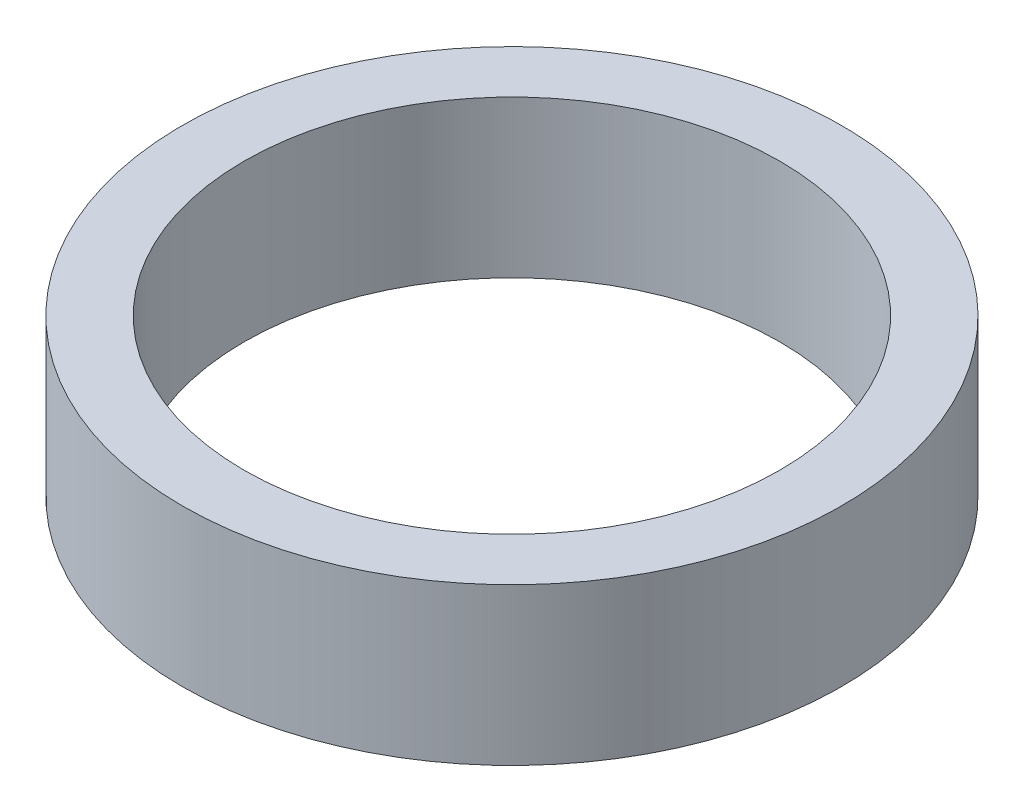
ISO-10303-21;
HEADER;
FILE_DESCRIPTION(('STEP AP214'),'2;1');
FILE_NAME('part.step','',(''),(''),'','','');
FILE_SCHEMA(('AUTOMOTIVE_DESIGN { 1 0 10303 214 1 1 1 1 }'));
ENDSEC;
DATA;
#1=APPLICATION_CONTEXT('core data for automotive mechanical design processes');
#2=APPLICATION_PROTOCOL_DEFINITION('international standard','automotive_design',2000,#1);
#3=PRODUCT_CONTEXT('',#1,'mechanical');
#4=PRODUCT('Part','Part','',(#3));
#5=PRODUCT_RELATED_PRODUCT_CATEGORY('part','',(#4));
#6=PRODUCT_DEFINITION_FORMATION('','',#4);
#7=PRODUCT_DEFINITION_CONTEXT('part definition',#1,'design');
#8=PRODUCT_DEFINITION('design','',#6,#7);
#9=PRODUCT_DEFINITION_SHAPE('','',#8);
#10=(LENGTH_UNIT() NAMED_UNIT(*) SI_UNIT(.MILLI.,.METRE.));
#11=(NAMED_UNIT(*) PLANE_ANGLE_UNIT() SI_UNIT($,.RADIAN.));
#12=(NAMED_UNIT(*) SI_UNIT($,.STERADIAN.) SOLID_ANGLE_UNIT());
#13=UNCERTAINTY_MEASURE_WITH_UNIT(LENGTH_MEASURE(1.E-05),#10,'distance_accuracy_value','');
#14=(GEOMETRIC_REPRESENTATION_CONTEXT(3) GLOBAL_UNCERTAINTY_ASSIGNED_CONTEXT((#13)) GLOBAL_UNIT_ASSIGNED_CONTEXT((#10,
#11,#12)) REPRESENTATION_CONTEXT('',''));
#15=CARTESIAN_POINT('',(0.,0.,0.));
#16=DIRECTION('',(0.,0.,1.));
#17=DIRECTION('',(1.,0.,0.));
#18=AXIS2_PLACEMENT_3D('',#15,#16,#17);
#19=CARTESIAN_POINT('',(0.,19.,0.));
#20=DIRECTION('',(0.,-1.,0.));
#21=DIRECTION('',(0.,0.,-1.));
#22=AXIS2_PLACEMENT_3D('',#19,#20,#21);
#23=CYLINDRICAL_SURFACE('',#22,40.);
#24=CARTESIAN_POINT('',(0.,19.,0.));
#25=DIRECTION('',(0.,1.,0.));
#26=DIRECTION('',(0.,0.,1.));
#27=AXIS2_PLACEMENT_3D('',#24,#25,#26);
#28=CIRCLE('',#27,40.);
#29=CARTESIAN_POINT('',(0.,19.,40.));
#30=VERTEX_POINT('',#29);
#31=EDGE_CURVE('E10',#30,#30,#28,.T.);
#32=ORIENTED_EDGE('',*,*,#31,.F.);
#33=EDGE_LOOP('',(#32));
#34=FACE_BOUND('',#33,.T.);
#35=CARTESIAN_POINT('',(0.,0.,0.));
#36=DIRECTION('',(0.,1.,0.));
#37=DIRECTION('',(0.,0.,1.));
#38=AXIS2_PLACEMENT_3D('',#35,#36,#37);
#39=CIRCLE('',#38,40.);
#40=CARTESIAN_POINT('',(0.,0.,40.));
#41=VERTEX_POINT('',#40);
#42=EDGE_CURVE('E34',#41,#41,#39,.T.);
#43=ORIENTED_EDGE('',*,*,#42,.T.);
#44=EDGE_LOOP('',(#43));
#45=FACE_BOUND('',#44,.T.);
#46=ADVANCED_FACE('F31',(#34,#45),#23,.T.);
#47=CARTESIAN_POINT('',(0.,19.,0.));
#48=DIRECTION('',(0.,1.,0.));
#49=DIRECTION('',(0.,0.,1.));
#50=AXIS2_PLACEMENT_3D('',#47,#48,#49);
#51=PLANE('',#50);
#52=CARTESIAN_POINT('',(0.,19.,0.));
#53=DIRECTION('',(0.,1.,0.));
#54=DIRECTION('',(0.,0.,1.));
#55=AXIS2_PLACEMENT_3D('',#52,#53,#54);
#56=CIRCLE('',#55,32.5);
#57=CARTESIAN_POINT('',(0.,19.,32.5));
#58=VERTEX_POINT('',#57);
#59=EDGE_CURVE('E43',#58,#58,#56,.T.);
#60=ORIENTED_EDGE('',*,*,#59,.F.);
#61=EDGE_LOOP('',(#60));
#62=FACE_BOUND('',#61,.T.);
#63=ORIENTED_EDGE('',*,*,#31,.T.);
#64=EDGE_LOOP('',(#63));
#65=FACE_BOUND('',#64,.T.);
#66=ADVANCED_FACE('F58',(#62,#65),#51,.T.);
#67=CARTESIAN_POINT('',(0.,0.,0.));
#68=DIRECTION('',(0.,1.,0.));
#69=DIRECTION('',(0.,0.,1.));
#70=AXIS2_PLACEMENT_3D('',#67,#68,#69);
#71=PLANE('',#70);
#72=CARTESIAN_POINT('',(0.,0.,0.));
#73=DIRECTION('',(0.,1.,0.));
#74=DIRECTION('',(0.,0.,1.));
#75=AXIS2_PLACEMENT_3D('',#72,#73,#74);
#76=CIRCLE('',#75,32.5);
#77=CARTESIAN_POINT('',(0.,0.,32.5));
#78=VERTEX_POINT('',#77);
#79=EDGE_CURVE('E41',#78,#78,#76,.T.);
#80=ORIENTED_EDGE('',*,*,#79,.T.);
#81=EDGE_LOOP('',(#80));
#82=FACE_BOUND('',#81,.T.);
#83=ORIENTED_EDGE('',*,*,#42,.F.);
#84=EDGE_LOOP('',(#83));
#85=FACE_BOUND('',#84,.T.);
#86=ADVANCED_FACE('F49',(#82,#85),#71,.F.);
#87=CARTESIAN_POINT('',(0.,0.,0.));
#88=DIRECTION('',(0.,1.,0.));
#89=DIRECTION('',(0.,0.,1.));
#90=AXIS2_PLACEMENT_3D('',#87,#88,#89);
#91=CYLINDRICAL_SURFACE('',#90,32.5);
#92=ORIENTED_EDGE('',*,*,#79,.F.);
#93=EDGE_LOOP('',(#92));
#94=FACE_BOUND('',#93,.T.);
#95=ORIENTED_EDGE('',*,*,#59,.T.);
#96=EDGE_LOOP('',(#95));
#97=FACE_BOUND('',#96,.T.);
#98=ADVANCED_FACE('F52',(#94,#97),#91,.F.);
#99=CLOSED_SHELL('',(#46,#66,#86,#98));
#100=MANIFOLD_SOLID_BREP('B2',#99);
#101=ADVANCED_BREP_SHAPE_REPRESENTATION('',(#18,#100),#14);
#102=SHAPE_DEFINITION_REPRESENTATION(#9,#101);
ENDSEC;
END-ISO-10303-21;
